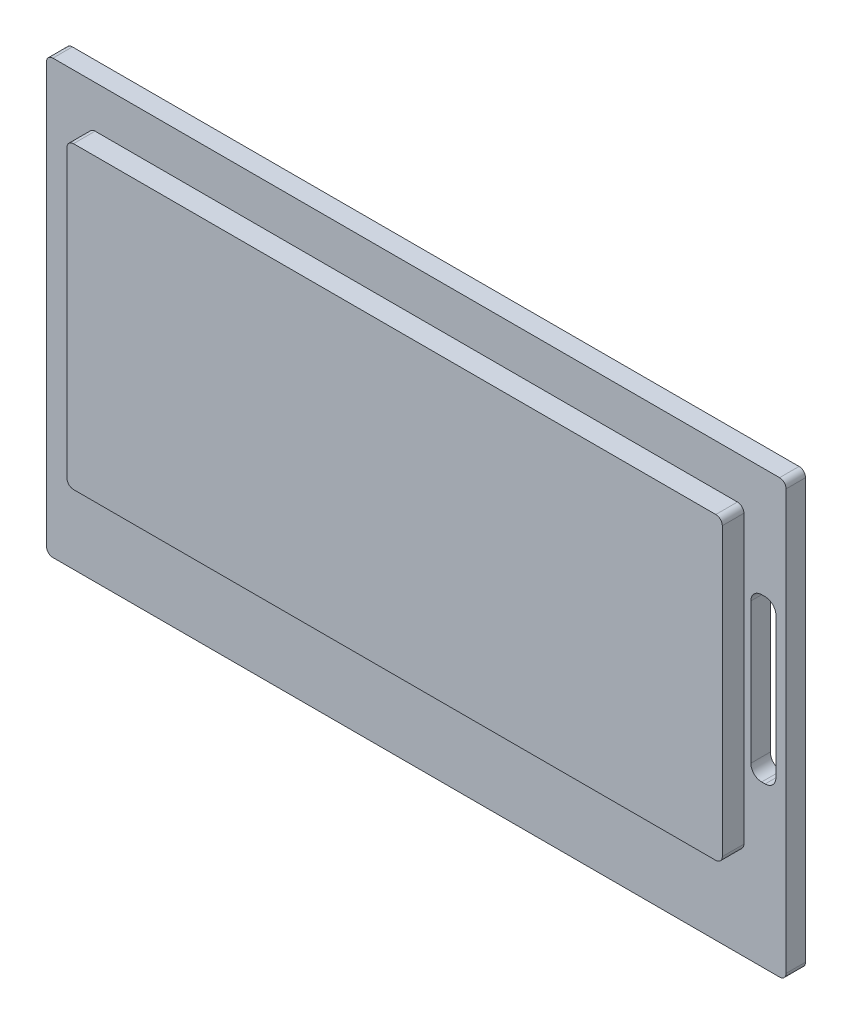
ISO-10303-21;
HEADER;
FILE_DESCRIPTION(('STEP AP214'),'2;1');
FILE_NAME('part.step','',(''),(''),'','','');
FILE_SCHEMA(('AUTOMOTIVE_DESIGN { 1 0 10303 214 1 1 1 1 }'));
ENDSEC;
DATA;
#1=APPLICATION_CONTEXT('core data for automotive mechanical design processes');
#2=APPLICATION_PROTOCOL_DEFINITION('international standard','automotive_design',2000,#1);
#3=PRODUCT_CONTEXT('',#1,'mechanical');
#4=PRODUCT('Part','Part','',(#3));
#5=PRODUCT_RELATED_PRODUCT_CATEGORY('part','',(#4));
#6=PRODUCT_DEFINITION_FORMATION('','',#4);
#7=PRODUCT_DEFINITION_CONTEXT('part definition',#1,'design');
#8=PRODUCT_DEFINITION('design','',#6,#7);
#9=PRODUCT_DEFINITION_SHAPE('','',#8);
#10=(LENGTH_UNIT() NAMED_UNIT(*) SI_UNIT(.MILLI.,.METRE.));
#11=(NAMED_UNIT(*) PLANE_ANGLE_UNIT() SI_UNIT($,.RADIAN.));
#12=(NAMED_UNIT(*) SI_UNIT($,.STERADIAN.) SOLID_ANGLE_UNIT());
#13=UNCERTAINTY_MEASURE_WITH_UNIT(LENGTH_MEASURE(1.E-05),#10,'distance_accuracy_value','');
#14=(GEOMETRIC_REPRESENTATION_CONTEXT(3) GLOBAL_UNCERTAINTY_ASSIGNED_CONTEXT((#13)) GLOBAL_UNIT_ASSIGNED_CONTEXT((#10,
#11,#12)) REPRESENTATION_CONTEXT('',''));
#15=CARTESIAN_POINT('',(0.,0.,0.));
#16=DIRECTION('',(0.,0.,1.));
#17=DIRECTION('',(1.,0.,0.));
#18=AXIS2_PLACEMENT_3D('',#15,#16,#17);
#19=CARTESIAN_POINT('',(284.921017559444,156.734180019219,19.));
#20=DIRECTION('',(0.,0.,-1.));
#21=DIRECTION('',(-1.,0.,0.));
#22=AXIS2_PLACEMENT_3D('',#19,#20,#21);
#23=CYLINDRICAL_SURFACE('',#22,3.);
#24=CARTESIAN_POINT('',(284.921017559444,156.734180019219,9.));
#25=DIRECTION('',(0.,0.,1.));
#26=DIRECTION('',(1.,0.,0.));
#27=AXIS2_PLACEMENT_3D('',#24,#25,#26);
#28=CIRCLE('',#27,3.);
#29=CARTESIAN_POINT('',(287.921017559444,156.734180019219,9.));
#30=VERTEX_POINT('',#29);
#31=CARTESIAN_POINT('',(284.921017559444,159.734180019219,9.));
#32=VERTEX_POINT('',#31);
#33=EDGE_CURVE('E318',#30,#32,#28,.T.);
#34=ORIENTED_EDGE('',*,*,#33,.F.);
#35=DIRECTION('',(0.,0.,-1.));
#36=VECTOR('',#35,1.);
#37=CARTESIAN_POINT('',(287.921017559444,156.734180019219,19.));
#38=LINE('',#37,#36);
#39=CARTESIAN_POINT('',(287.921017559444,156.734180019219,0.));
#40=VERTEX_POINT('',#39);
#41=EDGE_CURVE('E344',#30,#40,#38,.T.);
#42=ORIENTED_EDGE('',*,*,#41,.T.);
#43=CARTESIAN_POINT('',(284.921017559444,156.734180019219,0.));
#44=DIRECTION('',(0.,0.,1.));
#45=DIRECTION('',(-1.,0.,0.));
#46=AXIS2_PLACEMENT_3D('',#43,#44,#45);
#47=CIRCLE('',#46,3.);
#48=CARTESIAN_POINT('',(284.921017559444,159.734180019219,0.));
#49=VERTEX_POINT('',#48);
#50=EDGE_CURVE('E320',#40,#49,#47,.T.);
#51=ORIENTED_EDGE('',*,*,#50,.T.);
#52=DIRECTION('',(0.,0.,-1.));
#53=VECTOR('',#52,1.);
#54=CARTESIAN_POINT('',(284.921017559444,159.734180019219,19.));
#55=LINE('',#54,#53);
#56=EDGE_CURVE('E358',#32,#49,#55,.T.);
#57=ORIENTED_EDGE('',*,*,#56,.F.);
#58=EDGE_LOOP('',(#34,#42,#51,#57));
#59=FACE_BOUND('',#58,.T.);
#60=ADVANCED_FACE('F33',(#59),#23,.T.);
#61=CARTESIAN_POINT('',(-51.078982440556,159.734180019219,19.));
#62=DIRECTION('',(0.,-1.,0.));
#63=DIRECTION('',(0.,0.,-1.));
#64=AXIS2_PLACEMENT_3D('',#61,#62,#63);
#65=PLANE('',#64);
#66=DIRECTION('',(-1.,0.,0.));
#67=VECTOR('',#66,1.);
#68=CARTESIAN_POINT('',(-51.078982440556,159.734180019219,9.));
#69=LINE('',#68,#67);
#70=CARTESIAN_POINT('',(-51.078982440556,159.734180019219,9.));
#71=VERTEX_POINT('',#70);
#72=EDGE_CURVE('E316',#32,#71,#69,.T.);
#73=ORIENTED_EDGE('',*,*,#72,.F.);
#74=ORIENTED_EDGE('',*,*,#56,.T.);
#75=DIRECTION('',(-1.,0.,0.));
#76=VECTOR('',#75,1.);
#77=CARTESIAN_POINT('',(-51.078982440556,159.734180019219,0.));
#78=LINE('',#77,#76);
#79=CARTESIAN_POINT('',(-51.078982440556,159.734180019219,0.));
#80=VERTEX_POINT('',#79);
#81=EDGE_CURVE('E323',#49,#80,#78,.T.);
#82=ORIENTED_EDGE('',*,*,#81,.T.);
#83=DIRECTION('',(0.,0.,-1.));
#84=VECTOR('',#83,1.);
#85=CARTESIAN_POINT('',(-51.078982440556,159.734180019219,19.));
#86=LINE('',#85,#84);
#87=EDGE_CURVE('E356',#71,#80,#86,.T.);
#88=ORIENTED_EDGE('',*,*,#87,.F.);
#89=EDGE_LOOP('',(#73,#74,#82,#88));
#90=FACE_BOUND('',#89,.T.);
#91=ADVANCED_FACE('F414',(#90),#65,.F.);
#92=CARTESIAN_POINT('',(-51.078982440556,156.734180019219,19.));
#93=DIRECTION('',(0.,0.,-1.));
#94=DIRECTION('',(-1.,0.,0.));
#95=AXIS2_PLACEMENT_3D('',#92,#93,#94);
#96=CYLINDRICAL_SURFACE('',#95,3.);
#97=CARTESIAN_POINT('',(-51.078982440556,156.734180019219,9.));
#98=DIRECTION('',(0.,0.,1.));
#99=DIRECTION('',(1.,0.,0.));
#100=AXIS2_PLACEMENT_3D('',#97,#98,#99);
#101=CIRCLE('',#100,3.);
#102=CARTESIAN_POINT('',(-54.078982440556,156.734180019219,9.));
#103=VERTEX_POINT('',#102);
#104=EDGE_CURVE('E314',#71,#103,#101,.T.);
#105=ORIENTED_EDGE('',*,*,#104,.F.);
#106=ORIENTED_EDGE('',*,*,#87,.T.);
#107=CARTESIAN_POINT('',(-51.078982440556,156.734180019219,0.));
#108=DIRECTION('',(0.,0.,1.));
#109=DIRECTION('',(1.,0.,0.));
#110=AXIS2_PLACEMENT_3D('',#107,#108,#109);
#111=CIRCLE('',#110,3.);
#112=CARTESIAN_POINT('',(-54.078982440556,156.734180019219,0.));
#113=VERTEX_POINT('',#112);
#114=EDGE_CURVE('E326',#80,#113,#111,.T.);
#115=ORIENTED_EDGE('',*,*,#114,.T.);
#116=DIRECTION('',(0.,0.,-1.));
#117=VECTOR('',#116,1.);
#118=CARTESIAN_POINT('',(-54.078982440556,156.734180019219,19.));
#119=LINE('',#118,#117);
#120=EDGE_CURVE('E354',#103,#113,#119,.T.);
#121=ORIENTED_EDGE('',*,*,#120,.F.);
#122=EDGE_LOOP('',(#105,#106,#115,#121));
#123=FACE_BOUND('',#122,.T.);
#124=ADVANCED_FACE('F419',(#123),#96,.T.);
#125=CARTESIAN_POINT('',(-54.078982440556,156.734180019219,19.));
#126=DIRECTION('',(1.,0.,0.));
#127=DIRECTION('',(0.,1.,0.));
#128=AXIS2_PLACEMENT_3D('',#125,#126,#127);
#129=PLANE('',#128);
#130=DIRECTION('',(0.,-1.,0.));
#131=VECTOR('',#130,1.);
#132=CARTESIAN_POINT('',(-54.078982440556,156.734180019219,9.));
#133=LINE('',#132,#131);
#134=CARTESIAN_POINT('',(-54.078982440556,-37.2658199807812,9.));
#135=VERTEX_POINT('',#134);
#136=EDGE_CURVE('E312',#103,#135,#133,.T.);
#137=ORIENTED_EDGE('',*,*,#136,.F.);
#138=ORIENTED_EDGE('',*,*,#120,.T.);
#139=DIRECTION('',(0.,-1.,0.));
#140=VECTOR('',#139,1.);
#141=CARTESIAN_POINT('',(-54.078982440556,156.734180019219,0.));
#142=LINE('',#141,#140);
#143=CARTESIAN_POINT('',(-54.078982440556,-37.2658199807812,0.));
#144=VERTEX_POINT('',#143);
#145=EDGE_CURVE('E329',#113,#144,#142,.T.);
#146=ORIENTED_EDGE('',*,*,#145,.T.);
#147=DIRECTION('',(0.,0.,-1.));
#148=VECTOR('',#147,1.);
#149=CARTESIAN_POINT('',(-54.078982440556,-37.2658199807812,19.));
#150=LINE('',#149,#148);
#151=EDGE_CURVE('E352',#135,#144,#150,.T.);
#152=ORIENTED_EDGE('',*,*,#151,.F.);
#153=EDGE_LOOP('',(#137,#138,#146,#152));
#154=FACE_BOUND('',#153,.T.);
#155=ADVANCED_FACE('F442',(#154),#129,.F.);
#156=CARTESIAN_POINT('',(-51.078982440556,-37.2658199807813,19.));
#157=DIRECTION('',(0.,0.,-1.));
#158=DIRECTION('',(-1.,0.,0.));
#159=AXIS2_PLACEMENT_3D('',#156,#157,#158);
#160=CYLINDRICAL_SURFACE('',#159,3.);
#161=CARTESIAN_POINT('',(-51.078982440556,-37.2658199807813,9.));
#162=DIRECTION('',(0.,0.,1.));
#163=DIRECTION('',(1.,0.,0.));
#164=AXIS2_PLACEMENT_3D('',#161,#162,#163);
#165=CIRCLE('',#164,3.);
#166=CARTESIAN_POINT('',(-51.078982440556,-40.2658199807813,9.));
#167=VERTEX_POINT('',#166);
#168=EDGE_CURVE('E310',#135,#167,#165,.T.);
#169=ORIENTED_EDGE('',*,*,#168,.F.);
#170=ORIENTED_EDGE('',*,*,#151,.T.);
#171=CARTESIAN_POINT('',(-51.078982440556,-37.2658199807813,0.));
#172=DIRECTION('',(0.,0.,1.));
#173=DIRECTION('',(1.,0.,0.));
#174=AXIS2_PLACEMENT_3D('',#171,#172,#173);
#175=CIRCLE('',#174,3.);
#176=CARTESIAN_POINT('',(-51.078982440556,-40.2658199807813,0.));
#177=VERTEX_POINT('',#176);
#178=EDGE_CURVE('E332',#144,#177,#175,.T.);
#179=ORIENTED_EDGE('',*,*,#178,.T.);
#180=DIRECTION('',(0.,0.,-1.));
#181=VECTOR('',#180,1.);
#182=CARTESIAN_POINT('',(-51.078982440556,-40.2658199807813,19.));
#183=LINE('',#182,#181);
#184=EDGE_CURVE('E350',#167,#177,#183,.T.);
#185=ORIENTED_EDGE('',*,*,#184,.F.);
#186=EDGE_LOOP('',(#169,#170,#179,#185));
#187=FACE_BOUND('',#186,.T.);
#188=ADVANCED_FACE('F449',(#187),#160,.T.);
#189=CARTESIAN_POINT('',(-51.078982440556,-40.2658199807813,19.));
#190=DIRECTION('',(0.,1.,0.));
#191=DIRECTION('',(0.,0.,1.));
#192=AXIS2_PLACEMENT_3D('',#189,#190,#191);
#193=PLANE('',#192);
#194=DIRECTION('',(1.,0.,0.));
#195=VECTOR('',#194,1.);
#196=CARTESIAN_POINT('',(-51.078982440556,-40.2658199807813,9.));
#197=LINE('',#196,#195);
#198=CARTESIAN_POINT('',(284.921017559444,-40.2658199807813,9.));
#199=VERTEX_POINT('',#198);
#200=EDGE_CURVE('E308',#167,#199,#197,.T.);
#201=ORIENTED_EDGE('',*,*,#200,.F.);
#202=ORIENTED_EDGE('',*,*,#184,.T.);
#203=DIRECTION('',(1.,0.,0.));
#204=VECTOR('',#203,1.);
#205=CARTESIAN_POINT('',(-51.078982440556,-40.2658199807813,0.));
#206=LINE('',#205,#204);
#207=CARTESIAN_POINT('',(284.921017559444,-40.2658199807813,0.));
#208=VERTEX_POINT('',#207);
#209=EDGE_CURVE('E335',#177,#208,#206,.T.);
#210=ORIENTED_EDGE('',*,*,#209,.T.);
#211=DIRECTION('',(0.,0.,-1.));
#212=VECTOR('',#211,1.);
#213=CARTESIAN_POINT('',(284.921017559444,-40.2658199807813,19.));
#214=LINE('',#213,#212);
#215=EDGE_CURVE('E348',#199,#208,#214,.T.);
#216=ORIENTED_EDGE('',*,*,#215,.F.);
#217=EDGE_LOOP('',(#201,#202,#210,#216));
#218=FACE_BOUND('',#217,.T.);
#219=ADVANCED_FACE('F452',(#218),#193,.F.);
#220=CARTESIAN_POINT('',(284.921017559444,-37.2658199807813,19.));
#221=DIRECTION('',(0.,0.,-1.));
#222=DIRECTION('',(-1.,0.,0.));
#223=AXIS2_PLACEMENT_3D('',#220,#221,#222);
#224=CYLINDRICAL_SURFACE('',#223,3.);
#225=CARTESIAN_POINT('',(284.921017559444,-37.2658199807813,9.));
#226=DIRECTION('',(0.,0.,1.));
#227=DIRECTION('',(1.,0.,0.));
#228=AXIS2_PLACEMENT_3D('',#225,#226,#227);
#229=CIRCLE('',#228,3.);
#230=CARTESIAN_POINT('',(287.921017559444,-37.2658199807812,9.));
#231=VERTEX_POINT('',#230);
#232=EDGE_CURVE('E292',#199,#231,#229,.T.);
#233=ORIENTED_EDGE('',*,*,#232,.F.);
#234=ORIENTED_EDGE('',*,*,#215,.T.);
#235=CARTESIAN_POINT('',(284.921017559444,-37.2658199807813,0.));
#236=DIRECTION('',(0.,0.,1.));
#237=DIRECTION('',(1.,0.,0.));
#238=AXIS2_PLACEMENT_3D('',#235,#236,#237);
#239=CIRCLE('',#238,3.);
#240=CARTESIAN_POINT('',(287.921017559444,-37.2658199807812,0.));
#241=VERTEX_POINT('',#240);
#242=EDGE_CURVE('E338',#208,#241,#239,.T.);
#243=ORIENTED_EDGE('',*,*,#242,.T.);
#244=DIRECTION('',(0.,0.,-1.));
#245=VECTOR('',#244,1.);
#246=CARTESIAN_POINT('',(287.921017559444,-37.2658199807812,19.));
#247=LINE('',#246,#245);
#248=EDGE_CURVE('E346',#231,#241,#247,.T.);
#249=ORIENTED_EDGE('',*,*,#248,.F.);
#250=EDGE_LOOP('',(#233,#234,#243,#249));
#251=FACE_BOUND('',#250,.T.);
#252=ADVANCED_FACE('F456',(#251),#224,.T.);
#253=CARTESIAN_POINT('',(287.921017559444,156.734180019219,19.));
#254=DIRECTION('',(-1.,0.,0.));
#255=DIRECTION('',(0.,0.,1.));
#256=AXIS2_PLACEMENT_3D('',#253,#254,#255);
#257=PLANE('',#256);
#258=DIRECTION('',(0.,1.,0.));
#259=VECTOR('',#258,1.);
#260=CARTESIAN_POINT('',(287.921017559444,156.734180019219,9.));
#261=LINE('',#260,#259);
#262=EDGE_CURVE('E360',#231,#30,#261,.T.);
#263=ORIENTED_EDGE('',*,*,#262,.F.);
#264=ORIENTED_EDGE('',*,*,#248,.T.);
#265=DIRECTION('',(0.,1.,0.));
#266=VECTOR('',#265,1.);
#267=CARTESIAN_POINT('',(287.921017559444,156.734180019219,0.));
#268=LINE('',#267,#266);
#269=EDGE_CURVE('E341',#241,#40,#268,.T.);
#270=ORIENTED_EDGE('',*,*,#269,.T.);
#271=ORIENTED_EDGE('',*,*,#41,.F.);
#272=EDGE_LOOP('',(#263,#264,#270,#271));
#273=FACE_BOUND('',#272,.T.);
#274=ADVANCED_FACE('F428',(#273),#257,.F.);
#275=CARTESIAN_POINT('',(284.921017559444,156.734180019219,0.));
#276=DIRECTION('',(0.,0.,-1.));
#277=DIRECTION('',(-1.,0.,0.));
#278=AXIS2_PLACEMENT_3D('',#275,#276,#277);
#279=PLANE('',#278);
#280=CARTESIAN_POINT('',(278.221017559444,38.7341800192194,0.));
#281=DIRECTION('',(0.,0.,-1.));
#282=DIRECTION('',(-1.,0.,0.));
#283=AXIS2_PLACEMENT_3D('',#280,#281,#282);
#284=CIRCLE('',#283,5.);
#285=CARTESIAN_POINT('',(283.221017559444,38.7341800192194,0.));
#286=VERTEX_POINT('',#285);
#287=CARTESIAN_POINT('',(278.221017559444,33.7341800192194,0.));
#288=VERTEX_POINT('',#287);
#289=EDGE_CURVE('E47',#286,#288,#284,.T.);
#290=ORIENTED_EDGE('',*,*,#289,.F.);
#291=DIRECTION('',(0.,-1.,0.));
#292=VECTOR('',#291,1.);
#293=CARTESIAN_POINT('',(283.221017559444,103.734180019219,0.));
#294=LINE('',#293,#292);
#295=CARTESIAN_POINT('',(283.221017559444,103.734180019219,0.));
#296=VERTEX_POINT('',#295);
#297=EDGE_CURVE('E226',#296,#286,#294,.T.);
#298=ORIENTED_EDGE('',*,*,#297,.F.);
#299=CARTESIAN_POINT('',(278.221017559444,103.734180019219,0.));
#300=DIRECTION('',(0.,0.,-1.));
#301=DIRECTION('',(-1.,0.,0.));
#302=AXIS2_PLACEMENT_3D('',#299,#300,#301);
#303=CIRCLE('',#302,5.);
#304=CARTESIAN_POINT('',(278.221017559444,108.734180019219,0.));
#305=VERTEX_POINT('',#304);
#306=EDGE_CURVE('E223',#305,#296,#303,.T.);
#307=ORIENTED_EDGE('',*,*,#306,.F.);
#308=DIRECTION('',(1.,0.,0.));
#309=VECTOR('',#308,1.);
#310=CARTESIAN_POINT('',(278.221017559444,108.734180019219,0.));
#311=LINE('',#310,#309);
#312=CARTESIAN_POINT('',(276.621017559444,108.734180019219,0.));
#313=VERTEX_POINT('',#312);
#314=EDGE_CURVE('E220',#313,#305,#311,.T.);
#315=ORIENTED_EDGE('',*,*,#314,.F.);
#316=CARTESIAN_POINT('',(276.621017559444,103.734180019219,0.));
#317=DIRECTION('',(0.,0.,-1.));
#318=DIRECTION('',(1.,0.,0.));
#319=AXIS2_PLACEMENT_3D('',#316,#317,#318);
#320=CIRCLE('',#319,5.);
#321=CARTESIAN_POINT('',(271.621017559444,103.734180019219,0.));
#322=VERTEX_POINT('',#321);
#323=EDGE_CURVE('E214',#322,#313,#320,.T.);
#324=ORIENTED_EDGE('',*,*,#323,.F.);
#325=DIRECTION('',(0.,1.,0.));
#326=VECTOR('',#325,1.);
#327=CARTESIAN_POINT('',(271.621017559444,103.734180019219,0.));
#328=LINE('',#327,#326);
#329=CARTESIAN_POINT('',(271.621017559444,38.7341800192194,0.));
#330=VERTEX_POINT('',#329);
#331=EDGE_CURVE('E212',#330,#322,#328,.T.);
#332=ORIENTED_EDGE('',*,*,#331,.F.);
#333=CARTESIAN_POINT('',(276.621017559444,38.7341800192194,0.));
#334=DIRECTION('',(0.,0.,-1.));
#335=DIRECTION('',(-1.,0.,0.));
#336=AXIS2_PLACEMENT_3D('',#333,#334,#335);
#337=CIRCLE('',#336,5.);
#338=CARTESIAN_POINT('',(276.621017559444,33.7341800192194,0.));
#339=VERTEX_POINT('',#338);
#340=EDGE_CURVE('E195',#339,#330,#337,.T.);
#341=ORIENTED_EDGE('',*,*,#340,.F.);
#342=DIRECTION('',(-1.,0.,0.));
#343=VECTOR('',#342,1.);
#344=CARTESIAN_POINT('',(278.221017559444,33.7341800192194,0.));
#345=LINE('',#344,#343);
#346=EDGE_CURVE('E204',#288,#339,#345,.T.);
#347=ORIENTED_EDGE('',*,*,#346,.F.);
#348=EDGE_LOOP('',(#290,#298,#307,#315,#324,#332,#341,#347));
#349=FACE_BOUND('',#348,.T.);
#350=ORIENTED_EDGE('',*,*,#50,.F.);
#351=ORIENTED_EDGE('',*,*,#269,.F.);
#352=ORIENTED_EDGE('',*,*,#242,.F.);
#353=ORIENTED_EDGE('',*,*,#209,.F.);
#354=ORIENTED_EDGE('',*,*,#178,.F.);
#355=ORIENTED_EDGE('',*,*,#145,.F.);
#356=ORIENTED_EDGE('',*,*,#114,.F.);
#357=ORIENTED_EDGE('',*,*,#81,.F.);
#358=EDGE_LOOP('',(#350,#351,#352,#353,#354,#355,#356,#357));
#359=FACE_BOUND('',#358,.T.);
#360=ADVANCED_FACE('F208',(#349,#359),#279,.T.);
#361=CARTESIAN_POINT('',(116.921017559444,59.7341800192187,9.));
#362=DIRECTION('',(0.,0.,1.));
#363=DIRECTION('',(1.,0.,0.));
#364=AXIS2_PLACEMENT_3D('',#361,#362,#363);
#365=PLANE('',#364);
#366=CARTESIAN_POINT('',(278.221017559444,38.7341800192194,9.));
#367=DIRECTION('',(0.,0.,1.));
#368=DIRECTION('',(1.,0.,0.));
#369=AXIS2_PLACEMENT_3D('',#366,#367,#368);
#370=CIRCLE('',#369,5.);
#371=CARTESIAN_POINT('',(278.221017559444,33.7341800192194,9.));
#372=VERTEX_POINT('',#371);
#373=CARTESIAN_POINT('',(283.221017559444,38.7341800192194,9.));
#374=VERTEX_POINT('',#373);
#375=EDGE_CURVE('E12',#372,#374,#370,.T.);
#376=ORIENTED_EDGE('',*,*,#375,.F.);
#377=DIRECTION('',(1.,0.,0.));
#378=VECTOR('',#377,1.);
#379=CARTESIAN_POINT('',(116.921017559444,33.7341800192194,9.));
#380=LINE('',#379,#378);
#381=CARTESIAN_POINT('',(276.621017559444,33.7341800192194,9.));
#382=VERTEX_POINT('',#381);
#383=EDGE_CURVE('E362',#382,#372,#380,.T.);
#384=ORIENTED_EDGE('',*,*,#383,.F.);
#385=CARTESIAN_POINT('',(276.621017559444,38.7341800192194,9.));
#386=DIRECTION('',(0.,0.,1.));
#387=DIRECTION('',(1.,0.,0.));
#388=AXIS2_PLACEMENT_3D('',#385,#386,#387);
#389=CIRCLE('',#388,5.);
#390=CARTESIAN_POINT('',(271.621017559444,38.7341800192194,9.));
#391=VERTEX_POINT('',#390);
#392=EDGE_CURVE('E198',#391,#382,#389,.T.);
#393=ORIENTED_EDGE('',*,*,#392,.F.);
#394=DIRECTION('',(0.,-1.,0.));
#395=VECTOR('',#394,1.);
#396=CARTESIAN_POINT('',(271.621017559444,59.7341800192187,9.));
#397=LINE('',#396,#395);
#398=CARTESIAN_POINT('',(271.621017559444,103.734180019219,9.));
#399=VERTEX_POINT('',#398);
#400=EDGE_CURVE('E365',#399,#391,#397,.T.);
#401=ORIENTED_EDGE('',*,*,#400,.F.);
#402=CARTESIAN_POINT('',(276.621017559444,103.734180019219,9.));
#403=DIRECTION('',(0.,0.,1.));
#404=DIRECTION('',(1.,0.,0.));
#405=AXIS2_PLACEMENT_3D('',#402,#403,#404);
#406=CIRCLE('',#405,5.);
#407=CARTESIAN_POINT('',(276.621017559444,108.734180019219,9.));
#408=VERTEX_POINT('',#407);
#409=EDGE_CURVE('E367',#408,#399,#406,.T.);
#410=ORIENTED_EDGE('',*,*,#409,.F.);
#411=DIRECTION('',(-1.,0.,0.));
#412=VECTOR('',#411,1.);
#413=CARTESIAN_POINT('',(116.921017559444,108.734180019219,9.));
#414=LINE('',#413,#412);
#415=CARTESIAN_POINT('',(278.221017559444,108.734180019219,9.));
#416=VERTEX_POINT('',#415);
#417=EDGE_CURVE('E369',#416,#408,#414,.T.);
#418=ORIENTED_EDGE('',*,*,#417,.F.);
#419=CARTESIAN_POINT('',(278.221017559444,103.734180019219,9.));
#420=DIRECTION('',(0.,0.,1.));
#421=DIRECTION('',(1.,0.,0.));
#422=AXIS2_PLACEMENT_3D('',#419,#420,#421);
#423=CIRCLE('',#422,5.);
#424=CARTESIAN_POINT('',(283.221017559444,103.734180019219,9.));
#425=VERTEX_POINT('',#424);
#426=EDGE_CURVE('E371',#425,#416,#423,.T.);
#427=ORIENTED_EDGE('',*,*,#426,.F.);
#428=DIRECTION('',(0.,1.,0.));
#429=VECTOR('',#428,1.);
#430=CARTESIAN_POINT('',(283.221017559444,59.7341800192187,9.));
#431=LINE('',#430,#429);
#432=EDGE_CURVE('E40',#374,#425,#431,.T.);
#433=ORIENTED_EDGE('',*,*,#432,.F.);
#434=EDGE_LOOP('',(#376,#384,#393,#401,#410,#418,#427,#433));
#435=FACE_BOUND('',#434,.T.);
#436=DIRECTION('',(-1.,0.,0.));
#437=VECTOR('',#436,1.);
#438=CARTESIAN_POINT('',(-31.578982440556,140.234180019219,9.));
#439=LINE('',#438,#437);
#440=CARTESIAN_POINT('',(265.421017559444,140.234180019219,9.));
#441=VERTEX_POINT('',#440);
#442=CARTESIAN_POINT('',(-31.578982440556,140.234180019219,9.));
#443=VERTEX_POINT('',#442);
#444=EDGE_CURVE('E264',#441,#443,#439,.T.);
#445=ORIENTED_EDGE('',*,*,#444,.F.);
#446=CARTESIAN_POINT('',(265.421017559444,137.234180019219,9.));
#447=DIRECTION('',(0.,0.,1.));
#448=DIRECTION('',(-1.,0.,0.));
#449=AXIS2_PLACEMENT_3D('',#446,#447,#448);
#450=CIRCLE('',#449,3.);
#451=CARTESIAN_POINT('',(268.421017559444,137.234180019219,9.));
#452=VERTEX_POINT('',#451);
#453=EDGE_CURVE('E261',#452,#441,#450,.T.);
#454=ORIENTED_EDGE('',*,*,#453,.F.);
#455=DIRECTION('',(0.,1.,0.));
#456=VECTOR('',#455,1.);
#457=CARTESIAN_POINT('',(268.421017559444,137.234180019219,9.));
#458=LINE('',#457,#456);
#459=CARTESIAN_POINT('',(268.421017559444,4.73418001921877,9.));
#460=VERTEX_POINT('',#459);
#461=EDGE_CURVE('E258',#460,#452,#458,.T.);
#462=ORIENTED_EDGE('',*,*,#461,.F.);
#463=CARTESIAN_POINT('',(265.421017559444,4.73418001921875,9.));
#464=DIRECTION('',(0.,0.,1.));
#465=DIRECTION('',(1.,0.,0.));
#466=AXIS2_PLACEMENT_3D('',#463,#464,#465);
#467=CIRCLE('',#466,3.);
#468=CARTESIAN_POINT('',(265.421017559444,1.73418001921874,9.));
#469=VERTEX_POINT('',#468);
#470=EDGE_CURVE('E255',#469,#460,#467,.T.);
#471=ORIENTED_EDGE('',*,*,#470,.F.);
#472=DIRECTION('',(1.,0.,0.));
#473=VECTOR('',#472,1.);
#474=CARTESIAN_POINT('',(-31.578982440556,1.73418001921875,9.));
#475=LINE('',#474,#473);
#476=CARTESIAN_POINT('',(-31.578982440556,1.73418001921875,9.));
#477=VERTEX_POINT('',#476);
#478=EDGE_CURVE('E252',#477,#469,#475,.T.);
#479=ORIENTED_EDGE('',*,*,#478,.F.);
#480=CARTESIAN_POINT('',(-31.578982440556,4.73418001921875,9.));
#481=DIRECTION('',(0.,0.,1.));
#482=DIRECTION('',(1.,0.,0.));
#483=AXIS2_PLACEMENT_3D('',#480,#481,#482);
#484=CIRCLE('',#483,3.);
#485=CARTESIAN_POINT('',(-34.578982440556,4.73418001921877,9.));
#486=VERTEX_POINT('',#485);
#487=EDGE_CURVE('E249',#486,#477,#484,.T.);
#488=ORIENTED_EDGE('',*,*,#487,.F.);
#489=DIRECTION('',(0.,-1.,0.));
#490=VECTOR('',#489,1.);
#491=CARTESIAN_POINT('',(-34.578982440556,137.234180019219,9.));
#492=LINE('',#491,#490);
#493=CARTESIAN_POINT('',(-34.578982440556,137.234180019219,9.));
#494=VERTEX_POINT('',#493);
#495=EDGE_CURVE('E245',#494,#486,#492,.T.);
#496=ORIENTED_EDGE('',*,*,#495,.F.);
#497=CARTESIAN_POINT('',(-31.578982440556,137.234180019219,9.));
#498=DIRECTION('',(0.,0.,1.));
#499=DIRECTION('',(1.,0.,0.));
#500=AXIS2_PLACEMENT_3D('',#497,#498,#499);
#501=CIRCLE('',#500,3.);
#502=EDGE_CURVE('E242',#443,#494,#501,.T.);
#503=ORIENTED_EDGE('',*,*,#502,.F.);
#504=EDGE_LOOP('',(#445,#454,#462,#471,#479,#488,#496,#503));
#505=FACE_BOUND('',#504,.T.);
#506=ORIENTED_EDGE('',*,*,#33,.T.);
#507=ORIENTED_EDGE('',*,*,#72,.T.);
#508=ORIENTED_EDGE('',*,*,#104,.T.);
#509=ORIENTED_EDGE('',*,*,#136,.T.);
#510=ORIENTED_EDGE('',*,*,#168,.T.);
#511=ORIENTED_EDGE('',*,*,#200,.T.);
#512=ORIENTED_EDGE('',*,*,#232,.T.);
#513=ORIENTED_EDGE('',*,*,#262,.T.);
#514=EDGE_LOOP('',(#506,#507,#508,#509,#510,#511,#512,#513));
#515=FACE_BOUND('',#514,.T.);
#516=ADVANCED_FACE('F386',(#435,#505,#515),#365,.T.);
#517=CARTESIAN_POINT('',(-31.578982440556,137.234180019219,9.));
#518=DIRECTION('',(0.,0.,1.));
#519=DIRECTION('',(1.,0.,0.));
#520=AXIS2_PLACEMENT_3D('',#517,#518,#519);
#521=CYLINDRICAL_SURFACE('',#520,3.);
#522=CARTESIAN_POINT('',(-31.578982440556,137.234180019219,19.));
#523=DIRECTION('',(0.,0.,1.));
#524=DIRECTION('',(1.,0.,0.));
#525=AXIS2_PLACEMENT_3D('',#522,#523,#524);
#526=CIRCLE('',#525,3.);
#527=CARTESIAN_POINT('',(-31.578982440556,140.234180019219,19.));
#528=VERTEX_POINT('',#527);
#529=CARTESIAN_POINT('',(-34.578982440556,137.234180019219,19.));
#530=VERTEX_POINT('',#529);
#531=EDGE_CURVE('E231',#528,#530,#526,.T.);
#532=ORIENTED_EDGE('',*,*,#531,.F.);
#533=DIRECTION('',(0.,0.,1.));
#534=VECTOR('',#533,1.);
#535=CARTESIAN_POINT('',(-31.578982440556,140.234180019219,9.));
#536=LINE('',#535,#534);
#537=EDGE_CURVE('E290',#443,#528,#536,.T.);
#538=ORIENTED_EDGE('',*,*,#537,.F.);
#539=ORIENTED_EDGE('',*,*,#502,.T.);
#540=DIRECTION('',(0.,0.,1.));
#541=VECTOR('',#540,1.);
#542=CARTESIAN_POINT('',(-34.578982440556,137.234180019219,9.));
#543=LINE('',#542,#541);
#544=EDGE_CURVE('E267',#494,#530,#543,.T.);
#545=ORIENTED_EDGE('',*,*,#544,.T.);
#546=EDGE_LOOP('',(#532,#538,#539,#545));
#547=FACE_BOUND('',#546,.T.);
#548=ADVANCED_FACE('F505',(#547),#521,.T.);
#549=CARTESIAN_POINT('',(-31.578982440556,140.234180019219,9.));
#550=DIRECTION('',(0.,1.,0.));
#551=DIRECTION('',(0.,0.,1.));
#552=AXIS2_PLACEMENT_3D('',#549,#550,#551);
#553=PLANE('',#552);
#554=DIRECTION('',(-1.,0.,0.));
#555=VECTOR('',#554,1.);
#556=CARTESIAN_POINT('',(-31.578982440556,140.234180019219,19.));
#557=LINE('',#556,#555);
#558=CARTESIAN_POINT('',(265.421017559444,140.234180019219,19.));
#559=VERTEX_POINT('',#558);
#560=EDGE_CURVE('E246',#559,#528,#557,.T.);
#561=ORIENTED_EDGE('',*,*,#560,.F.);
#562=DIRECTION('',(0.,0.,1.));
#563=VECTOR('',#562,1.);
#564=CARTESIAN_POINT('',(265.421017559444,140.234180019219,9.));
#565=LINE('',#564,#563);
#566=EDGE_CURVE('E293',#441,#559,#565,.T.);
#567=ORIENTED_EDGE('',*,*,#566,.F.);
#568=ORIENTED_EDGE('',*,*,#444,.T.);
#569=ORIENTED_EDGE('',*,*,#537,.T.);
#570=EDGE_LOOP('',(#561,#567,#568,#569));
#571=FACE_BOUND('',#570,.T.);
#572=ADVANCED_FACE('F510',(#571),#553,.T.);
#573=CARTESIAN_POINT('',(265.421017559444,137.234180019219,9.));
#574=DIRECTION('',(0.,0.,1.));
#575=DIRECTION('',(1.,0.,0.));
#576=AXIS2_PLACEMENT_3D('',#573,#574,#575);
#577=CYLINDRICAL_SURFACE('',#576,3.);
#578=CARTESIAN_POINT('',(265.421017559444,137.234180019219,19.));
#579=DIRECTION('',(0.,0.,1.));
#580=DIRECTION('',(-1.,0.,0.));
#581=AXIS2_PLACEMENT_3D('',#578,#579,#580);
#582=CIRCLE('',#581,3.);
#583=CARTESIAN_POINT('',(268.421017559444,137.234180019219,19.));
#584=VERTEX_POINT('',#583);
#585=EDGE_CURVE('E285',#584,#559,#582,.T.);
#586=ORIENTED_EDGE('',*,*,#585,.F.);
#587=DIRECTION('',(0.,0.,1.));
#588=VECTOR('',#587,1.);
#589=CARTESIAN_POINT('',(268.421017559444,137.234180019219,9.));
#590=LINE('',#589,#588);
#591=EDGE_CURVE('E295',#452,#584,#590,.T.);
#592=ORIENTED_EDGE('',*,*,#591,.F.);
#593=ORIENTED_EDGE('',*,*,#453,.T.);
#594=ORIENTED_EDGE('',*,*,#566,.T.);
#595=EDGE_LOOP('',(#586,#592,#593,#594));
#596=FACE_BOUND('',#595,.T.);
#597=ADVANCED_FACE('F522',(#596),#577,.T.);
#598=CARTESIAN_POINT('',(268.421017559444,137.234180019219,9.));
#599=DIRECTION('',(1.,0.,0.));
#600=DIRECTION('',(0.,1.,0.));
#601=AXIS2_PLACEMENT_3D('',#598,#599,#600);
#602=PLANE('',#601);
#603=DIRECTION('',(0.,1.,0.));
#604=VECTOR('',#603,1.);
#605=CARTESIAN_POINT('',(268.421017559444,137.234180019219,19.));
#606=LINE('',#605,#604);
#607=CARTESIAN_POINT('',(268.421017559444,4.73418001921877,19.));
#608=VERTEX_POINT('',#607);
#609=EDGE_CURVE('E282',#608,#584,#606,.T.);
#610=ORIENTED_EDGE('',*,*,#609,.F.);
#611=DIRECTION('',(0.,0.,1.));
#612=VECTOR('',#611,1.);
#613=CARTESIAN_POINT('',(268.421017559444,4.73418001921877,9.));
#614=LINE('',#613,#612);
#615=EDGE_CURVE('E297',#460,#608,#614,.T.);
#616=ORIENTED_EDGE('',*,*,#615,.F.);
#617=ORIENTED_EDGE('',*,*,#461,.T.);
#618=ORIENTED_EDGE('',*,*,#591,.T.);
#619=EDGE_LOOP('',(#610,#616,#617,#618));
#620=FACE_BOUND('',#619,.T.);
#621=ADVANCED_FACE('F531',(#620),#602,.T.);
#622=CARTESIAN_POINT('',(265.421017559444,4.73418001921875,9.));
#623=DIRECTION('',(0.,0.,1.));
#624=DIRECTION('',(1.,0.,0.));
#625=AXIS2_PLACEMENT_3D('',#622,#623,#624);
#626=CYLINDRICAL_SURFACE('',#625,3.);
#627=CARTESIAN_POINT('',(265.421017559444,4.73418001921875,19.));
#628=DIRECTION('',(0.,0.,1.));
#629=DIRECTION('',(1.,0.,0.));
#630=AXIS2_PLACEMENT_3D('',#627,#628,#629);
#631=CIRCLE('',#630,3.);
#632=CARTESIAN_POINT('',(265.421017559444,1.73418001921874,19.));
#633=VERTEX_POINT('',#632);
#634=EDGE_CURVE('E279',#633,#608,#631,.T.);
#635=ORIENTED_EDGE('',*,*,#634,.F.);
#636=DIRECTION('',(0.,0.,1.));
#637=VECTOR('',#636,1.);
#638=CARTESIAN_POINT('',(265.421017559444,1.73418001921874,9.));
#639=LINE('',#638,#637);
#640=EDGE_CURVE('E299',#469,#633,#639,.T.);
#641=ORIENTED_EDGE('',*,*,#640,.F.);
#642=ORIENTED_EDGE('',*,*,#470,.T.);
#643=ORIENTED_EDGE('',*,*,#615,.T.);
#644=EDGE_LOOP('',(#635,#641,#642,#643));
#645=FACE_BOUND('',#644,.T.);
#646=ADVANCED_FACE('F541',(#645),#626,.T.);
#647=CARTESIAN_POINT('',(-31.578982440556,1.73418001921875,9.));
#648=DIRECTION('',(0.,-1.,0.));
#649=DIRECTION('',(0.,0.,-1.));
#650=AXIS2_PLACEMENT_3D('',#647,#648,#649);
#651=PLANE('',#650);
#652=DIRECTION('',(1.,0.,0.));
#653=VECTOR('',#652,1.);
#654=CARTESIAN_POINT('',(-31.578982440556,1.73418001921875,19.));
#655=LINE('',#654,#653);
#656=CARTESIAN_POINT('',(-31.578982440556,1.73418001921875,19.));
#657=VERTEX_POINT('',#656);
#658=EDGE_CURVE('E276',#657,#633,#655,.T.);
#659=ORIENTED_EDGE('',*,*,#658,.F.);
#660=DIRECTION('',(0.,0.,1.));
#661=VECTOR('',#660,1.);
#662=CARTESIAN_POINT('',(-31.578982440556,1.73418001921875,9.));
#663=LINE('',#662,#661);
#664=EDGE_CURVE('E301',#477,#657,#663,.T.);
#665=ORIENTED_EDGE('',*,*,#664,.F.);
#666=ORIENTED_EDGE('',*,*,#478,.T.);
#667=ORIENTED_EDGE('',*,*,#640,.T.);
#668=EDGE_LOOP('',(#659,#665,#666,#667));
#669=FACE_BOUND('',#668,.T.);
#670=ADVANCED_FACE('F551',(#669),#651,.T.);
#671=CARTESIAN_POINT('',(-31.578982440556,4.73418001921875,9.));
#672=DIRECTION('',(0.,0.,1.));
#673=DIRECTION('',(1.,0.,0.));
#674=AXIS2_PLACEMENT_3D('',#671,#672,#673);
#675=CYLINDRICAL_SURFACE('',#674,3.);
#676=CARTESIAN_POINT('',(-31.578982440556,4.73418001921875,19.));
#677=DIRECTION('',(0.,0.,1.));
#678=DIRECTION('',(1.,0.,0.));
#679=AXIS2_PLACEMENT_3D('',#676,#677,#678);
#680=CIRCLE('',#679,3.);
#681=CARTESIAN_POINT('',(-34.578982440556,4.73418001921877,19.));
#682=VERTEX_POINT('',#681);
#683=EDGE_CURVE('E273',#682,#657,#680,.T.);
#684=ORIENTED_EDGE('',*,*,#683,.F.);
#685=DIRECTION('',(0.,0.,1.));
#686=VECTOR('',#685,1.);
#687=CARTESIAN_POINT('',(-34.578982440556,4.73418001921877,9.));
#688=LINE('',#687,#686);
#689=EDGE_CURVE('E303',#486,#682,#688,.T.);
#690=ORIENTED_EDGE('',*,*,#689,.F.);
#691=ORIENTED_EDGE('',*,*,#487,.T.);
#692=ORIENTED_EDGE('',*,*,#664,.T.);
#693=EDGE_LOOP('',(#684,#690,#691,#692));
#694=FACE_BOUND('',#693,.T.);
#695=ADVANCED_FACE('F561',(#694),#675,.T.);
#696=CARTESIAN_POINT('',(-34.578982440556,137.234180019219,9.));
#697=DIRECTION('',(-1.,0.,0.));
#698=DIRECTION('',(0.,-1.,0.));
#699=AXIS2_PLACEMENT_3D('',#696,#697,#698);
#700=PLANE('',#699);
#701=DIRECTION('',(0.,-1.,0.));
#702=VECTOR('',#701,1.);
#703=CARTESIAN_POINT('',(-34.578982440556,137.234180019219,19.));
#704=LINE('',#703,#702);
#705=EDGE_CURVE('E270',#530,#682,#704,.T.);
#706=ORIENTED_EDGE('',*,*,#705,.F.);
#707=ORIENTED_EDGE('',*,*,#544,.F.);
#708=ORIENTED_EDGE('',*,*,#495,.T.);
#709=ORIENTED_EDGE('',*,*,#689,.T.);
#710=EDGE_LOOP('',(#706,#707,#708,#709));
#711=FACE_BOUND('',#710,.T.);
#712=ADVANCED_FACE('F408',(#711),#700,.T.);
#713=CARTESIAN_POINT('',(284.921017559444,156.734180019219,19.));
#714=DIRECTION('',(0.,0.,-1.));
#715=DIRECTION('',(-1.,0.,0.));
#716=AXIS2_PLACEMENT_3D('',#713,#714,#715);
#717=PLANE('',#716);
#718=ORIENTED_EDGE('',*,*,#531,.T.);
#719=ORIENTED_EDGE('',*,*,#705,.T.);
#720=ORIENTED_EDGE('',*,*,#683,.T.);
#721=ORIENTED_EDGE('',*,*,#658,.T.);
#722=ORIENTED_EDGE('',*,*,#634,.T.);
#723=ORIENTED_EDGE('',*,*,#609,.T.);
#724=ORIENTED_EDGE('',*,*,#585,.T.);
#725=ORIENTED_EDGE('',*,*,#560,.T.);
#726=EDGE_LOOP('',(#718,#719,#720,#721,#722,#723,#724,#725));
#727=FACE_BOUND('',#726,.T.);
#728=ADVANCED_FACE('F401',(#727),#717,.F.);
#729=CARTESIAN_POINT('',(278.221017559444,38.7341800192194,19.));
#730=DIRECTION('',(0.,0.,-1.));
#731=DIRECTION('',(-1.,0.,0.));
#732=AXIS2_PLACEMENT_3D('',#729,#730,#731);
#733=CYLINDRICAL_SURFACE('',#732,5.);
#734=ORIENTED_EDGE('',*,*,#375,.T.);
#735=DIRECTION('',(0.,0.,-1.));
#736=VECTOR('',#735,1.);
#737=CARTESIAN_POINT('',(283.221017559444,38.7341800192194,19.));
#738=LINE('',#737,#736);
#739=EDGE_CURVE('E229',#374,#286,#738,.T.);
#740=ORIENTED_EDGE('',*,*,#739,.T.);
#741=ORIENTED_EDGE('',*,*,#289,.T.);
#742=DIRECTION('',(0.,0.,-1.));
#743=VECTOR('',#742,1.);
#744=CARTESIAN_POINT('',(278.221017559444,33.7341800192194,19.));
#745=LINE('',#744,#743);
#746=EDGE_CURVE('E201',#372,#288,#745,.T.);
#747=ORIENTED_EDGE('',*,*,#746,.F.);
#748=EDGE_LOOP('',(#734,#740,#741,#747));
#749=FACE_BOUND('',#748,.T.);
#750=ADVANCED_FACE('F399',(#749),#733,.F.);
#751=CARTESIAN_POINT('',(283.221017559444,103.734180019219,19.));
#752=DIRECTION('',(1.,0.,0.));
#753=DIRECTION('',(0.,0.,-1.));
#754=AXIS2_PLACEMENT_3D('',#751,#752,#753);
#755=PLANE('',#754);
#756=ORIENTED_EDGE('',*,*,#432,.T.);
#757=DIRECTION('',(0.,0.,-1.));
#758=VECTOR('',#757,1.);
#759=CARTESIAN_POINT('',(283.221017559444,103.734180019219,19.));
#760=LINE('',#759,#758);
#761=EDGE_CURVE('E232',#425,#296,#760,.T.);
#762=ORIENTED_EDGE('',*,*,#761,.T.);
#763=ORIENTED_EDGE('',*,*,#297,.T.);
#764=ORIENTED_EDGE('',*,*,#739,.F.);
#765=EDGE_LOOP('',(#756,#762,#763,#764));
#766=FACE_BOUND('',#765,.T.);
#767=ADVANCED_FACE('F376',(#766),#755,.F.);
#768=CARTESIAN_POINT('',(278.221017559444,103.734180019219,19.));
#769=DIRECTION('',(0.,0.,-1.));
#770=DIRECTION('',(-1.,0.,0.));
#771=AXIS2_PLACEMENT_3D('',#768,#769,#770);
#772=CYLINDRICAL_SURFACE('',#771,5.);
#773=ORIENTED_EDGE('',*,*,#426,.T.);
#774=DIRECTION('',(0.,0.,-1.));
#775=VECTOR('',#774,1.);
#776=CARTESIAN_POINT('',(278.221017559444,108.734180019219,19.));
#777=LINE('',#776,#775);
#778=EDGE_CURVE('E234',#416,#305,#777,.T.);
#779=ORIENTED_EDGE('',*,*,#778,.T.);
#780=ORIENTED_EDGE('',*,*,#306,.T.);
#781=ORIENTED_EDGE('',*,*,#761,.F.);
#782=EDGE_LOOP('',(#773,#779,#780,#781));
#783=FACE_BOUND('',#782,.T.);
#784=ADVANCED_FACE('F381',(#783),#772,.F.);
#785=CARTESIAN_POINT('',(278.221017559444,108.734180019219,19.));
#786=DIRECTION('',(0.,1.,0.));
#787=DIRECTION('',(0.,0.,1.));
#788=AXIS2_PLACEMENT_3D('',#785,#786,#787);
#789=PLANE('',#788);
#790=ORIENTED_EDGE('',*,*,#417,.T.);
#791=DIRECTION('',(0.,0.,-1.));
#792=VECTOR('',#791,1.);
#793=CARTESIAN_POINT('',(276.621017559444,108.734180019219,19.));
#794=LINE('',#793,#792);
#795=EDGE_CURVE('E236',#408,#313,#794,.T.);
#796=ORIENTED_EDGE('',*,*,#795,.T.);
#797=ORIENTED_EDGE('',*,*,#314,.T.);
#798=ORIENTED_EDGE('',*,*,#778,.F.);
#799=EDGE_LOOP('',(#790,#796,#797,#798));
#800=FACE_BOUND('',#799,.T.);
#801=ADVANCED_FACE('F392',(#800),#789,.F.);
#802=CARTESIAN_POINT('',(276.621017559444,103.734180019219,19.));
#803=DIRECTION('',(0.,0.,-1.));
#804=DIRECTION('',(-1.,0.,0.));
#805=AXIS2_PLACEMENT_3D('',#802,#803,#804);
#806=CYLINDRICAL_SURFACE('',#805,5.);
#807=ORIENTED_EDGE('',*,*,#409,.T.);
#808=DIRECTION('',(0.,0.,-1.));
#809=VECTOR('',#808,1.);
#810=CARTESIAN_POINT('',(271.621017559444,103.734180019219,19.));
#811=LINE('',#810,#809);
#812=EDGE_CURVE('E238',#399,#322,#811,.T.);
#813=ORIENTED_EDGE('',*,*,#812,.T.);
#814=ORIENTED_EDGE('',*,*,#323,.T.);
#815=ORIENTED_EDGE('',*,*,#795,.F.);
#816=EDGE_LOOP('',(#807,#813,#814,#815));
#817=FACE_BOUND('',#816,.T.);
#818=ADVANCED_FACE('F394',(#817),#806,.F.);
#819=CARTESIAN_POINT('',(271.621017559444,103.734180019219,19.));
#820=DIRECTION('',(-1.,0.,0.));
#821=DIRECTION('',(0.,0.,1.));
#822=AXIS2_PLACEMENT_3D('',#819,#820,#821);
#823=PLANE('',#822);
#824=ORIENTED_EDGE('',*,*,#400,.T.);
#825=DIRECTION('',(0.,0.,-1.));
#826=VECTOR('',#825,1.);
#827=CARTESIAN_POINT('',(271.621017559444,38.7341800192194,19.));
#828=LINE('',#827,#826);
#829=EDGE_CURVE('E200',#391,#330,#828,.T.);
#830=ORIENTED_EDGE('',*,*,#829,.T.);
#831=ORIENTED_EDGE('',*,*,#331,.T.);
#832=ORIENTED_EDGE('',*,*,#812,.F.);
#833=EDGE_LOOP('',(#824,#830,#831,#832));
#834=FACE_BOUND('',#833,.T.);
#835=ADVANCED_FACE('F398',(#834),#823,.F.);
#836=CARTESIAN_POINT('',(276.621017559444,38.7341800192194,19.));
#837=DIRECTION('',(0.,0.,-1.));
#838=DIRECTION('',(-1.,0.,0.));
#839=AXIS2_PLACEMENT_3D('',#836,#837,#838);
#840=CYLINDRICAL_SURFACE('',#839,5.);
#841=ORIENTED_EDGE('',*,*,#392,.T.);
#842=DIRECTION('',(0.,0.,-1.));
#843=VECTOR('',#842,1.);
#844=CARTESIAN_POINT('',(276.621017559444,33.7341800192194,19.));
#845=LINE('',#844,#843);
#846=EDGE_CURVE('E55',#382,#339,#845,.T.);
#847=ORIENTED_EDGE('',*,*,#846,.T.);
#848=ORIENTED_EDGE('',*,*,#340,.T.);
#849=ORIENTED_EDGE('',*,*,#829,.F.);
#850=EDGE_LOOP('',(#841,#847,#848,#849));
#851=FACE_BOUND('',#850,.T.);
#852=ADVANCED_FACE('F192',(#851),#840,.F.);
#853=CARTESIAN_POINT('',(278.221017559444,33.7341800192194,19.));
#854=DIRECTION('',(0.,-1.,0.));
#855=DIRECTION('',(0.,0.,-1.));
#856=AXIS2_PLACEMENT_3D('',#853,#854,#855);
#857=PLANE('',#856);
#858=ORIENTED_EDGE('',*,*,#383,.T.);
#859=ORIENTED_EDGE('',*,*,#746,.T.);
#860=ORIENTED_EDGE('',*,*,#346,.T.);
#861=ORIENTED_EDGE('',*,*,#846,.F.);
#862=EDGE_LOOP('',(#858,#859,#860,#861));
#863=FACE_BOUND('',#862,.T.);
#864=ADVANCED_FACE('F205',(#863),#857,.F.);
#865=CLOSED_SHELL('',(#60,#91,#124,#155,#188,#219,#252,#274,#360,#516,#548,#572,#597,#621,#646,
#670,#695,#712,#728,#750,#767,#784,#801,#818,#835,#852,#864));
#866=MANIFOLD_SOLID_BREP('B2',#865);
#867=ADVANCED_BREP_SHAPE_REPRESENTATION('',(#18,#866),#14);
#868=SHAPE_DEFINITION_REPRESENTATION(#9,#867);
ENDSEC;
END-ISO-10303-21;
